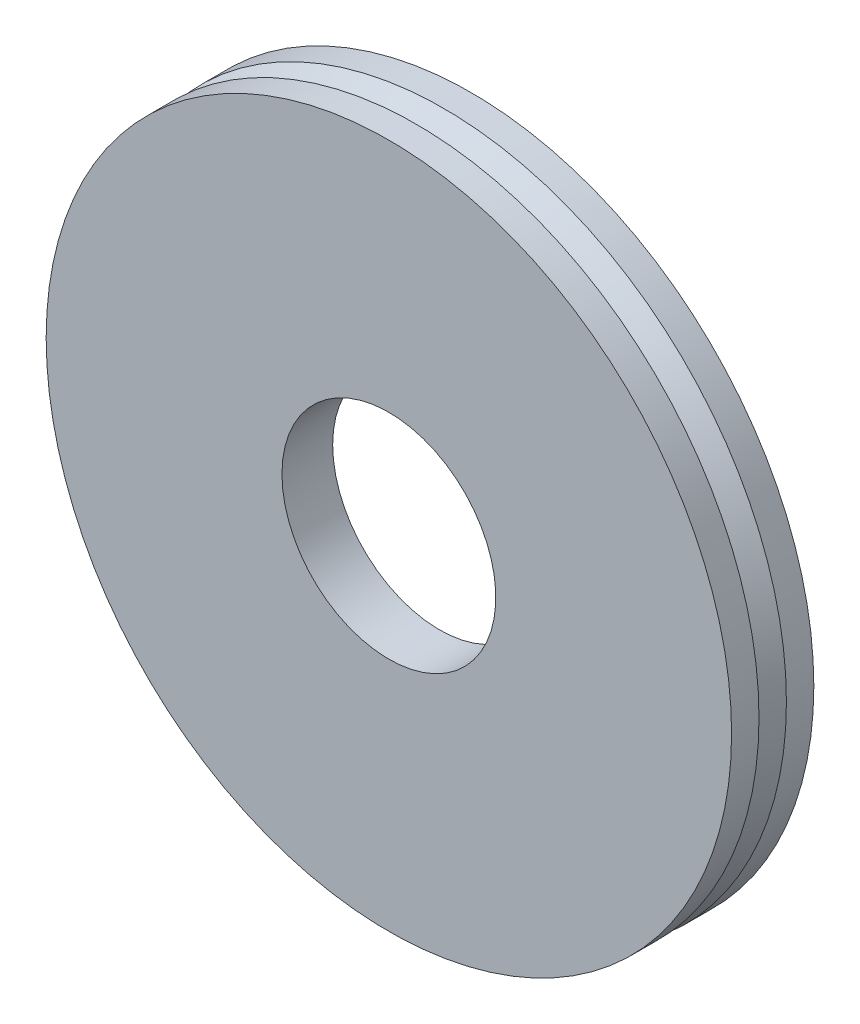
from build123d import *


with BuildPart() as part:
    # Esquisse1 → R_volution1 (revolve)
    with BuildSketch(Plane(origin=(0, 0, 0), x_dir=(0, 0, -1), z_dir=(1, 0, 0)), mode=Mode.PRIVATE) as r_volution1_sk:
        Polygon((1.85, 3.9), (1.85, 5.9), (3, 5.9), (3, 12.5), (2, 12.5), (1, 12), (1, 12.5), (0, 12.5), (0, 3.9), align=None)
    revolve(r_volution1_sk.sketch.rotate(Axis((0, 0, 0), (0, 0, 1)), 90), axis=Axis((0, 0, 0), (0, 0, 1)))


solid = part.part
